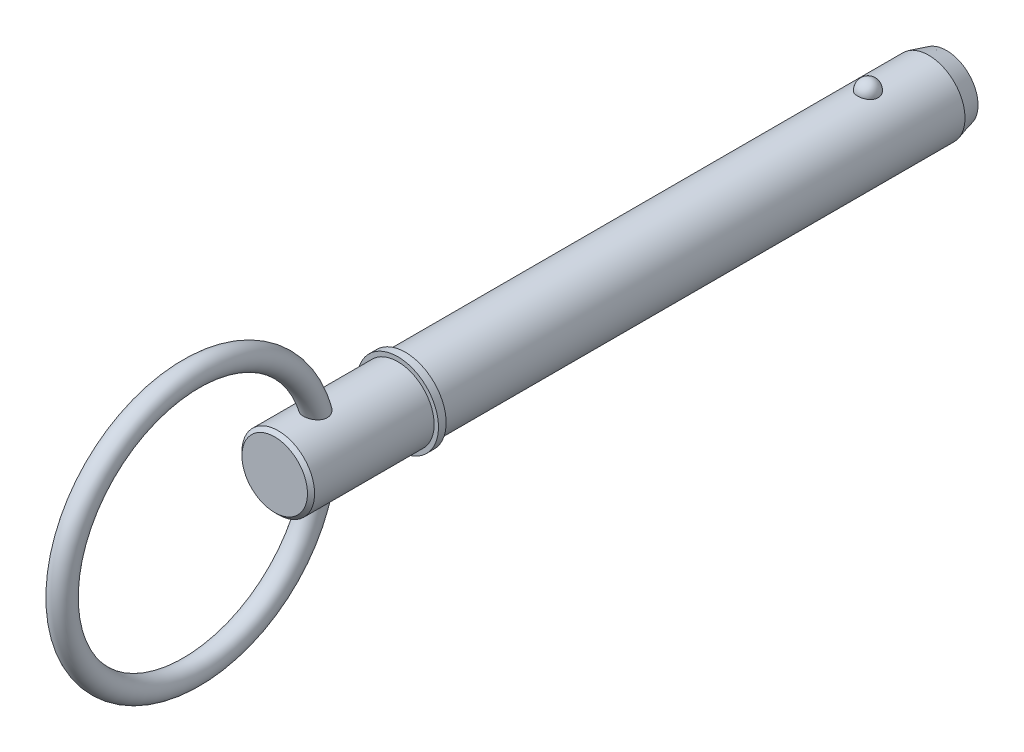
ISO-10303-21;
HEADER;
FILE_DESCRIPTION(('STEP AP214'),'2;1');
FILE_NAME('part.step','',(''),(''),'','','');
FILE_SCHEMA(('AUTOMOTIVE_DESIGN { 1 0 10303 214 1 1 1 1 }'));
ENDSEC;
DATA;
#1=APPLICATION_CONTEXT('core data for automotive mechanical design processes');
#2=APPLICATION_PROTOCOL_DEFINITION('international standard','automotive_design',2000,#1);
#3=PRODUCT_CONTEXT('',#1,'mechanical');
#4=PRODUCT('Part','Part','',(#3));
#5=PRODUCT_RELATED_PRODUCT_CATEGORY('part','',(#4));
#6=PRODUCT_DEFINITION_FORMATION('','',#4);
#7=PRODUCT_DEFINITION_CONTEXT('part definition',#1,'design');
#8=PRODUCT_DEFINITION('design','',#6,#7);
#9=PRODUCT_DEFINITION_SHAPE('','',#8);
#10=(LENGTH_UNIT() NAMED_UNIT(*) SI_UNIT(.MILLI.,.METRE.));
#11=(NAMED_UNIT(*) PLANE_ANGLE_UNIT() SI_UNIT($,.RADIAN.));
#12=(NAMED_UNIT(*) SI_UNIT($,.STERADIAN.) SOLID_ANGLE_UNIT());
#13=UNCERTAINTY_MEASURE_WITH_UNIT(LENGTH_MEASURE(1.E-05),#10,'distance_accuracy_value','');
#14=(GEOMETRIC_REPRESENTATION_CONTEXT(3) GLOBAL_UNCERTAINTY_ASSIGNED_CONTEXT((#13)) GLOBAL_UNIT_ASSIGNED_CONTEXT((#10,
#11,#12)) REPRESENTATION_CONTEXT('',''));
#15=CARTESIAN_POINT('',(0.,0.,0.));
#16=DIRECTION('',(0.,0.,1.));
#17=DIRECTION('',(1.,0.,0.));
#18=AXIS2_PLACEMENT_3D('',#15,#16,#17);
#19=CARTESIAN_POINT('',(0.,0.,88.9));
#20=DIRECTION('',(0.,0.,-1.));
#21=DIRECTION('',(-1.,0.,0.));
#22=AXIS2_PLACEMENT_3D('',#19,#20,#21);
#23=CYLINDRICAL_SURFACE('',#22,7.145);
#24=CARTESIAN_POINT('',(1.99971637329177,6.85945766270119,-2.02));
#25=CARTESIAN_POINT('',(1.9997145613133,6.85945924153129,-1.9070973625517));
#26=CARTESIAN_POINT('',(1.99051486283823,6.86216053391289,-1.79417185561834));
#27=CARTESIAN_POINT('',(1.95393597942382,6.87266409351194,-1.57152267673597));
#28=CARTESIAN_POINT('',(1.92655029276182,6.88046818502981,-1.46180016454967));
#29=CARTESIAN_POINT('',(1.85429435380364,6.90029063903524,-1.24873107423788));
#30=CARTESIAN_POINT('',(1.80943177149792,6.91230715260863,-1.14538172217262));
#31=CARTESIAN_POINT('',(1.70333474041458,6.93921158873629,-0.947875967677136));
#32=CARTESIAN_POINT('',(1.64210059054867,6.95409945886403,-0.853719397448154));
#33=CARTESIAN_POINT('',(1.5044381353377,6.98517577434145,-0.67672157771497));
#34=CARTESIAN_POINT('',(1.42793505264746,7.00137037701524,-0.593939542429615));
#35=CARTESIAN_POINT('',(1.26189697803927,7.03319066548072,-0.442536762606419));
#36=CARTESIAN_POINT('',(1.17236198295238,7.04881635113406,-0.37391602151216));
#37=CARTESIAN_POINT('',(0.982932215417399,7.0777121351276,-0.252935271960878));
#38=CARTESIAN_POINT('',(0.883068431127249,7.09098897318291,-0.200528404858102));
#39=CARTESIAN_POINT('',(0.675560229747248,7.11375589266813,-0.11321230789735));
#40=CARTESIAN_POINT('',(0.567916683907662,7.12324639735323,-0.0783011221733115));
#41=CARTESIAN_POINT('',(0.350006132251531,7.13724173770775,-0.02747075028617));
#42=CARTESIAN_POINT('',(0.239822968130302,7.14183447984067,-0.0112162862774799));
#43=CARTESIAN_POINT('',(0.0181946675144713,7.14583597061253,0.00296794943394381));
#44=CARTESIAN_POINT('',(-0.0932503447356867,7.14524522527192,0.000899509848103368));
#45=CARTESIAN_POINT('',(-0.312527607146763,7.13899247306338,-0.0213331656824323));
#46=CARTESIAN_POINT('',(-0.420388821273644,7.13340426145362,-0.0412340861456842));
#47=CARTESIAN_POINT('',(-0.631141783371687,7.11785474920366,-0.098204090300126));
#48=CARTESIAN_POINT('',(-0.734033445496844,7.10789337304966,-0.135273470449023));
#49=CARTESIAN_POINT('',(-0.932634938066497,7.08458058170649,-0.225826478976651));
#50=CARTESIAN_POINT('',(-1.02829911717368,7.07120963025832,-0.279405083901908));
#51=CARTESIAN_POINT('',(-1.20927180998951,7.04252043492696,-0.401457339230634));
#52=CARTESIAN_POINT('',(-1.29457925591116,7.02720199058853,-0.469932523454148));
#53=CARTESIAN_POINT('',(-1.45423311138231,6.995926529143,-0.621438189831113));
#54=CARTESIAN_POINT('',(-1.5283348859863,6.97996288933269,-0.704725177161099));
#55=CARTESIAN_POINT('',(-1.66169281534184,6.94942414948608,-0.882667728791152));
#56=CARTESIAN_POINT('',(-1.72094789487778,6.93484915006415,-0.977324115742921));
#57=CARTESIAN_POINT('',(-1.82375276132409,6.90853186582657,-1.17661373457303));
#58=CARTESIAN_POINT('',(-1.86711024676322,6.8968248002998,-1.28135093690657));
#59=CARTESIAN_POINT('',(-1.9360425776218,6.87779420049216,-1.4968998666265));
#60=CARTESIAN_POINT('',(-1.96161794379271,6.87047053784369,-1.60771141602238));
#61=CARTESIAN_POINT('',(-1.99427437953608,6.86106309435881,-1.83176258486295));
#62=CARTESIAN_POINT('',(-2.00143373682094,6.8589571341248,-1.9449898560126));
#63=CARTESIAN_POINT('',(-1.99730449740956,6.86016064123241,-2.17107603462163));
#64=CARTESIAN_POINT('',(-1.98601641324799,6.86346995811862,-2.28393495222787));
#65=CARTESIAN_POINT('',(-1.94538181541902,6.87509649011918,-2.5054843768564));
#66=CARTESIAN_POINT('',(-1.91612773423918,6.88338806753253,-2.61419321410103));
#67=CARTESIAN_POINT('',(-1.84036449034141,6.90402888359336,-2.82501243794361));
#68=CARTESIAN_POINT('',(-1.79385462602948,6.91637828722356,-2.92712255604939));
#69=CARTESIAN_POINT('',(-1.68442067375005,6.94384180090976,-3.12247704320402));
#70=CARTESIAN_POINT('',(-1.62140729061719,6.95897081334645,-3.21566929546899));
#71=CARTESIAN_POINT('',(-1.4806650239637,6.99026742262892,-3.38999412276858));
#72=CARTESIAN_POINT('',(-1.40293556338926,7.00643506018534,-3.47112622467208));
#73=CARTESIAN_POINT('',(-1.2344320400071,7.03807960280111,-3.61938672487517));
#74=CARTESIAN_POINT('',(-1.1436092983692,7.05355363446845,-3.68646046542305));
#75=CARTESIAN_POINT('',(-0.9515914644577,7.08201263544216,-3.80431973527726));
#76=CARTESIAN_POINT('',(-0.850397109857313,7.09499778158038,-3.85510642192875));
#77=CARTESIAN_POINT('',(-0.641823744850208,7.11687679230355,-3.93839532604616));
#78=CARTESIAN_POINT('',(-0.534539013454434,7.1258202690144,-3.9711204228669));
#79=CARTESIAN_POINT('',(-0.315743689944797,7.1388605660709,-4.01830716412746));
#80=CARTESIAN_POINT('',(-0.204233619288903,7.14295798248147,-4.03277105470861));
#81=CARTESIAN_POINT('',(0.0175518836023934,7.14582273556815,-4.04291389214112));
#82=CARTESIAN_POINT('',(0.127809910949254,7.14469090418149,-4.03894819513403));
#83=CARTESIAN_POINT('',(0.346044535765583,7.13745046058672,-4.01315850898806));
#84=CARTESIAN_POINT('',(0.454021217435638,7.13134203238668,-3.99133518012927));
#85=CARTESIAN_POINT('',(0.664227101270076,7.11483713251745,-3.93057164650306));
#86=CARTESIAN_POINT('',(0.766477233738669,7.10445761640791,-3.89169908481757));
#87=CARTESIAN_POINT('',(0.96292921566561,7.08050813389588,-3.79792023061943));
#88=CARTESIAN_POINT('',(1.05713054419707,7.06693796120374,-3.7430129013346));
#89=CARTESIAN_POINT('',(1.23644031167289,7.03780007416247,-3.61765173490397));
#90=CARTESIAN_POINT('',(1.32138387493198,7.0222044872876,-3.54696861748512));
#91=CARTESIAN_POINT('',(1.47830582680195,6.99085504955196,-3.39245228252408));
#92=CARTESIAN_POINT('',(1.55028198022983,6.97510117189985,-3.30861680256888));
#93=CARTESIAN_POINT('',(1.68063701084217,6.94485803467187,-3.12843058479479));
#94=CARTESIAN_POINT('',(1.73875175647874,6.93039619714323,-3.03188405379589));
#95=CARTESIAN_POINT('',(1.83823393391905,6.90467783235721,-2.83015210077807));
#96=CARTESIAN_POINT('',(1.87960712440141,6.89342020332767,-2.72496966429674));
#97=CARTESIAN_POINT('',(1.94111647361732,6.87633596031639,-2.52050234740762));
#98=CARTESIAN_POINT('',(1.96305249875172,6.87005682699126,-2.42179225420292));
#99=CARTESIAN_POINT('',(1.99235308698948,6.86161702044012,-2.22206084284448));
#100=CARTESIAN_POINT('',(1.99971799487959,6.85945624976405,-2.12103957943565));
#101=CARTESIAN_POINT('',(1.99971637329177,6.85945766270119,-2.02));
#102=B_SPLINE_CURVE_WITH_KNOTS('',3,(#24,#25,#26,#27,#28,#29,#30,#31,#32,#33,#34,#35,#36,#37,
#38,#39,#40,#41,#42,#43,#44,#45,#46,#47,#48,#49,#50,#51,#52,#53,#54,#55,#56,#57,#58,#59,#60,#61,
#62,#63,#64,#65,#66,#67,#68,#69,#70,#71,#72,#73,#74,#75,#76,#77,#78,#79,#80,#81,#82,#83,#84,#85,
#86,#87,#88,#89,#90,#91,#92,#93,#94,#95,#96,#97,#98,#99,#100,#101),.UNSPECIFIED.,.T.,.F.,(4,2,2,
2,2,2,2,2,2,2,2,2,2,2,2,2,2,2,2,2,2,2,2,2,2,2,2,2,2,2,2,2,2,2,2,2,2,2,4),(0.,0.338345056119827,
0.67681114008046,1.01512885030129,1.35344038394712,1.69345130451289,2.0334623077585,
2.37248128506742,2.71146235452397,3.04425125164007,3.37700766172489,3.70493009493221,
4.03285819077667,4.36270921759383,4.69259422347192,5.02887632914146,5.36518278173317,
5.70543263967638,6.04567253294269,6.38446363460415,6.72324532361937,7.0602984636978,
7.39736530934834,7.73629500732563,8.07523799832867,8.4154752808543,8.7556883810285,
9.09160363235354,9.42747756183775,9.75690239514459,10.0863150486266,10.4144324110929,
10.7425709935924,11.0758313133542,11.4091490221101,11.748385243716,12.0875046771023,
12.3903058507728,12.6930998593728),.UNSPECIFIED.);
#103=CARTESIAN_POINT('',(1.99971637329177,6.85945766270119,-2.02));
#104=VERTEX_POINT('',#103);
#105=EDGE_CURVE('E102',#104,#104,#102,.T.);
#106=ORIENTED_EDGE('',*,*,#105,.T.);
#107=EDGE_LOOP('',(#106));
#108=FACE_BOUND('',#107,.T.);
#109=CARTESIAN_POINT('',(0.,0.,-13.9499999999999));
#110=DIRECTION('',(0.,0.,-1.));
#111=DIRECTION('',(-1.,0.,0.));
#112=AXIS2_PLACEMENT_3D('',#109,#110,#111);
#113=CIRCLE('',#112,7.145);
#114=CARTESIAN_POINT('',(-7.145,0.,-13.9499999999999));
#115=VERTEX_POINT('',#114);
#116=EDGE_CURVE('E110',#115,#115,#113,.F.);
#117=ORIENTED_EDGE('',*,*,#116,.T.);
#118=EDGE_LOOP('',(#117));
#119=FACE_BOUND('',#118,.T.);
#120=CARTESIAN_POINT('',(0.,0.,88.9));
#121=DIRECTION('',(0.,0.,1.));
#122=DIRECTION('',(1.,0.,0.));
#123=AXIS2_PLACEMENT_3D('',#120,#121,#122);
#124=CIRCLE('',#123,7.145);
#125=CARTESIAN_POINT('',(7.145,0.,88.9));
#126=VERTEX_POINT('',#125);
#127=EDGE_CURVE('E108',#126,#126,#124,.T.);
#128=ORIENTED_EDGE('',*,*,#127,.F.);
#129=EDGE_LOOP('',(#128));
#130=FACE_BOUND('',#129,.T.);
#131=ADVANCED_FACE('F39',(#108,#119,#130),#23,.T.);
#132=CARTESIAN_POINT('',(0.,0.,-17.45));
#133=DIRECTION('',(0.,0.,-1.));
#134=DIRECTION('',(-1.,0.,0.));
#135=AXIS2_PLACEMENT_3D('',#132,#133,#134);
#136=PLANE('',#135);
#137=CARTESIAN_POINT('',(0.,0.,-17.45));
#138=DIRECTION('',(0.,0.,-1.));
#139=DIRECTION('',(-1.,0.,0.));
#140=AXIS2_PLACEMENT_3D('',#137,#138,#139);
#141=CIRCLE('',#140,6.20717782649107);
#142=CARTESIAN_POINT('',(-6.20717782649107,0.,-17.45));
#143=VERTEX_POINT('',#142);
#144=EDGE_CURVE('E142',#143,#143,#141,.T.);
#145=ORIENTED_EDGE('',*,*,#144,.T.);
#146=EDGE_LOOP('',(#145));
#147=FACE_BOUND('',#146,.T.);
#148=ADVANCED_FACE('F88',(#147),#136,.T.);
#149=CARTESIAN_POINT('',(0.,0.,-17.45));
#150=DIRECTION('',(0.,0.,1.));
#151=DIRECTION('',(1.,0.,0.));
#152=AXIS2_PLACEMENT_3D('',#149,#150,#151);
#153=CONICAL_SURFACE('',#152,6.20717782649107,0.261799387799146);
#154=ORIENTED_EDGE('',*,*,#116,.F.);
#155=EDGE_LOOP('',(#154));
#156=FACE_BOUND('',#155,.T.);
#157=ORIENTED_EDGE('',*,*,#144,.F.);
#158=EDGE_LOOP('',(#157));
#159=FACE_BOUND('',#158,.T.);
#160=ADVANCED_FACE('F94',(#156,#159),#153,.T.);
#161=CARTESIAN_POINT('',(0.,7.145,-2.02));
#162=DIRECTION('',(0.,1.,0.));
#163=DIRECTION('',(0.,0.,1.));
#164=AXIS2_PLACEMENT_3D('',#161,#162,#163);
#165=SPHERICAL_SURFACE('',#164,2.02);
#166=ORIENTED_EDGE('',*,*,#105,.F.);
#167=EDGE_LOOP('',(#166));
#168=FACE_BOUND('',#167,.T.);
#169=ADVANCED_FACE('F113',(#168),#165,.T.);
#170=CARTESIAN_POINT('',(0.,0.,88.9));
#171=DIRECTION('',(0.,0.,-1.));
#172=DIRECTION('',(-1.,0.,0.));
#173=AXIS2_PLACEMENT_3D('',#170,#171,#172);
#174=PLANE('',#173);
#175=ORIENTED_EDGE('',*,*,#127,.T.);
#176=EDGE_LOOP('',(#175));
#177=FACE_BOUND('',#176,.T.);
#178=CARTESIAN_POINT('',(0.,0.,88.9));
#179=DIRECTION('',(0.,0.,-1.));
#180=DIRECTION('',(-1.,0.,0.));
#181=AXIS2_PLACEMENT_3D('',#178,#179,#180);
#182=CIRCLE('',#181,8.);
#183=CARTESIAN_POINT('',(-8.,0.,88.9));
#184=VERTEX_POINT('',#183);
#185=EDGE_CURVE('E109',#184,#184,#182,.T.);
#186=ORIENTED_EDGE('',*,*,#185,.T.);
#187=EDGE_LOOP('',(#186));
#188=FACE_BOUND('',#187,.T.);
#189=ADVANCED_FACE('F117',(#177,#188),#174,.T.);
#190=CARTESIAN_POINT('',(0.,0.,33.7287874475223));
#191=DIRECTION('',(0.,0.,-1.));
#192=DIRECTION('',(-1.,0.,0.));
#193=AXIS2_PLACEMENT_3D('',#190,#191,#192);
#194=CYLINDRICAL_SURFACE('',#193,8.);
#195=CARTESIAN_POINT('',(0.,0.,90.4));
#196=DIRECTION('',(0.,0.,-1.));
#197=DIRECTION('',(-1.,0.,0.));
#198=AXIS2_PLACEMENT_3D('',#195,#196,#197);
#199=CIRCLE('',#198,8.);
#200=CARTESIAN_POINT('',(-8.,0.,90.4));
#201=VERTEX_POINT('',#200);
#202=EDGE_CURVE('E134',#201,#201,#199,.T.);
#203=ORIENTED_EDGE('',*,*,#202,.T.);
#204=EDGE_LOOP('',(#203));
#205=FACE_BOUND('',#204,.T.);
#206=ORIENTED_EDGE('',*,*,#185,.F.);
#207=EDGE_LOOP('',(#206));
#208=FACE_BOUND('',#207,.T.);
#209=ADVANCED_FACE('F121',(#205,#208),#194,.T.);
#210=CARTESIAN_POINT('',(0.,8.,90.4));
#211=DIRECTION('',(0.,0.,1.));
#212=DIRECTION('',(1.,0.,0.));
#213=AXIS2_PLACEMENT_3D('',#210,#211,#212);
#214=PLANE('',#213);
#215=CARTESIAN_POINT('',(0.,0.,90.4));
#216=DIRECTION('',(0.,0.,1.));
#217=DIRECTION('',(1.,0.,0.));
#218=AXIS2_PLACEMENT_3D('',#215,#216,#217);
#219=CIRCLE('',#218,7.145);
#220=CARTESIAN_POINT('',(7.145,0.,90.4));
#221=VERTEX_POINT('',#220);
#222=EDGE_CURVE('E112',#221,#221,#219,.T.);
#223=ORIENTED_EDGE('',*,*,#222,.F.);
#224=EDGE_LOOP('',(#223));
#225=FACE_BOUND('',#224,.T.);
#226=ORIENTED_EDGE('',*,*,#202,.F.);
#227=EDGE_LOOP('',(#226));
#228=FACE_BOUND('',#227,.T.);
#229=ADVANCED_FACE('F85',(#225,#228),#214,.T.);
#230=CARTESIAN_POINT('',(0.,0.,114.6));
#231=DIRECTION('',(0.,0.,-1.));
#232=DIRECTION('',(-1.,0.,0.));
#233=AXIS2_PLACEMENT_3D('',#230,#231,#232);
#234=CYLINDRICAL_SURFACE('',#233,7.145);
#235=CARTESIAN_POINT('',(-1.03551034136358,-7.0695645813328,104.530259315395));
#236=CARTESIAN_POINT('',(-0.923225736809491,-7.08601142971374,104.474402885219));
#237=CARTESIAN_POINT('',(-0.806039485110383,-7.10042113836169,104.427835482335));
#238=CARTESIAN_POINT('',(-0.565173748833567,-7.1236385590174,104.354279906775));
#239=CARTESIAN_POINT('',(-0.441495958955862,-7.13244772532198,104.327286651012));
#240=CARTESIAN_POINT('',(-0.191106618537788,-7.14354309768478,104.293450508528));
#241=CARTESIAN_POINT('',(-0.0643945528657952,-7.14582818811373,104.286611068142));
#242=CARTESIAN_POINT('',(0.188443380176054,-7.14363337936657,104.293241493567));
#243=CARTESIAN_POINT('',(0.314569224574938,-7.13915321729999,104.306712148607));
#244=CARTESIAN_POINT('',(0.562499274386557,-7.12390574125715,104.35364165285));
#245=CARTESIAN_POINT('',(0.684308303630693,-7.11314569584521,104.387077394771));
#246=CARTESIAN_POINT('',(0.920329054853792,-7.08647538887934,104.473194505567));
#247=CARTESIAN_POINT('',(1.03454038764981,-7.07056486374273,104.525876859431));
#248=CARTESIAN_POINT('',(1.25232634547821,-7.03526161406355,104.6494470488));
#249=CARTESIAN_POINT('',(1.35588248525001,-7.01586299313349,104.72036580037));
#250=CARTESIAN_POINT('',(1.54916093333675,-6.9757352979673,104.878757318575));
#251=CARTESIAN_POINT('',(1.63888414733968,-6.95500631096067,104.966229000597));
#252=CARTESIAN_POINT('',(1.80113983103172,-6.91475703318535,105.154727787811));
#253=CARTESIAN_POINT('',(1.8738192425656,-6.89522757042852,105.255626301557));
#254=CARTESIAN_POINT('',(2.00091178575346,-6.85942834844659,105.46884010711));
#255=CARTESIAN_POINT('',(2.05532963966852,-6.8431577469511,105.581152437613));
#256=CARTESIAN_POINT('',(2.14350100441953,-6.81604873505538,105.811194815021));
#257=CARTESIAN_POINT('',(2.17770329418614,-6.80509340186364,105.928739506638));
#258=CARTESIAN_POINT('',(2.22691394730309,-6.7891497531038,106.168149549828));
#259=CARTESIAN_POINT('',(2.2419216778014,-6.7841616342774,106.290015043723));
#260=CARTESIAN_POINT('',(2.25313992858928,-6.78044381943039,106.53580699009));
#261=CARTESIAN_POINT('',(2.24917302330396,-6.78177319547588,106.659742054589));
#262=CARTESIAN_POINT('',(2.22301329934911,-6.79039131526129,106.905438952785));
#263=CARTESIAN_POINT('',(2.20081491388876,-6.79768187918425,107.0272001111));
#264=CARTESIAN_POINT('',(2.13702421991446,-6.81801706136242,107.275287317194));
#265=CARTESIAN_POINT('',(2.09404815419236,-6.83146790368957,107.401223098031));
#266=CARTESIAN_POINT('',(1.9898638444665,-6.86253672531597,107.644824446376));
#267=CARTESIAN_POINT('',(1.9286413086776,-6.88015796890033,107.762483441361));
#268=CARTESIAN_POINT('',(1.78274362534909,-6.91947130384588,107.997497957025));
#269=CARTESIAN_POINT('',(1.69640701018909,-6.94139021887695,108.113789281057));
#270=CARTESIAN_POINT('',(1.50503944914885,-6.98537683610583,108.329799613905));
#271=CARTESIAN_POINT('',(1.40001969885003,-7.00744444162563,108.429528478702));
#272=CARTESIAN_POINT('',(1.19221781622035,-7.04548349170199,108.593170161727));
#273=CARTESIAN_POINT('',(1.09203347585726,-7.06185586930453,108.66028599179));
#274=CARTESIAN_POINT('',(0.881607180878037,-7.09119477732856,108.777337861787));
#275=CARTESIAN_POINT('',(0.771372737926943,-7.10416382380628,108.827286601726));
#276=CARTESIAN_POINT('',(0.542622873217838,-7.12529560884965,108.907475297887));
#277=CARTESIAN_POINT('',(0.424058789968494,-7.13342692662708,108.93758654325));
#278=CARTESIAN_POINT('',(0.183155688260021,-7.1436662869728,108.975370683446));
#279=CARTESIAN_POINT('',(0.0608191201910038,-7.14577815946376,108.983057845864));
#280=CARTESIAN_POINT('',(-0.169367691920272,-7.14381572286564,108.975860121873));
#281=CARTESIAN_POINT('',(-0.277308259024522,-7.14040669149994,108.963402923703));
#282=CARTESIAN_POINT('',(-0.489468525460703,-7.12900651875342,108.921156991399));
#283=CARTESIAN_POINT('',(-0.593687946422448,-7.12101503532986,108.891366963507));
#284=CARTESIAN_POINT('',(-0.796149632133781,-7.10123695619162,108.815987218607));
#285=CARTESIAN_POINT('',(-0.894373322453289,-7.08943921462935,108.770351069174));
#286=CARTESIAN_POINT('',(-1.08274371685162,-7.06312621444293,108.665336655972));
#287=CARTESIAN_POINT('',(-1.17288754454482,-7.04860999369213,108.605953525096));
#288=CARTESIAN_POINT('',(-1.35484961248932,-7.01605385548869,108.467113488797));
#289=CARTESIAN_POINT('',(-1.44541008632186,-6.99780069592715,108.386061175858));
#290=CARTESIAN_POINT('',(-1.61364655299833,-6.96093393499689,108.211599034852));
#291=CARTESIAN_POINT('',(-1.69131381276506,-6.94232009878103,108.118180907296));
#292=CARTESIAN_POINT('',(-1.843300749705,-6.90364386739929,107.906608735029));
#293=CARTESIAN_POINT('',(-1.9154309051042,-6.88377370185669,107.786839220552));
#294=CARTESIAN_POINT('',(-2.04002946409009,-6.84788436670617,107.536875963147));
#295=CARTESIAN_POINT('',(-2.09248830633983,-6.83186707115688,107.406677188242));
#296=CARTESIAN_POINT('',(-2.17795964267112,-6.80511869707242,107.132555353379));
#297=CARTESIAN_POINT('',(-2.20992909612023,-6.79467512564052,106.988274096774));
#298=CARTESIAN_POINT('',(-2.24813111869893,-6.78213595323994,106.695984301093));
#299=CARTESIAN_POINT('',(-2.25438316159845,-6.78003403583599,106.547978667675));
#300=CARTESIAN_POINT('',(-2.24011368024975,-6.78475868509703,106.265430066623));
#301=CARTESIAN_POINT('',(-2.22172362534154,-6.79087455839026,106.130769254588));
#302=CARTESIAN_POINT('',(-2.16145328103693,-6.81029672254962,105.867367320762));
#303=CARTESIAN_POINT('',(-2.11958615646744,-6.82359898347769,105.738622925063));
#304=CARTESIAN_POINT('',(-2.01784121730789,-6.85433303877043,105.502267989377));
#305=CARTESIAN_POINT('',(-1.95982394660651,-6.8713108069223,105.393792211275));
#306=CARTESIAN_POINT('',(-1.82642155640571,-6.90796511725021,105.188591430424));
#307=CARTESIAN_POINT('',(-1.75103235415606,-6.92764229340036,105.091869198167));
#308=CARTESIAN_POINT('',(-1.57825515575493,-6.96911949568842,104.905408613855));
#309=CARTESIAN_POINT('',(-1.47957996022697,-6.99096237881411,104.81687037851));
#310=CARTESIAN_POINT('',(-1.26760341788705,-7.0324852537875,104.658840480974));
#311=CARTESIAN_POINT('',(-1.15429989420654,-7.05216492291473,104.589351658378));
#312=CARTESIAN_POINT('',(-1.03551034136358,-7.0695645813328,104.530259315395));
#313=B_SPLINE_CURVE_WITH_KNOTS('',3,(#235,#236,#237,#238,#239,#240,#241,#242,#243,#244,#245,
#246,#247,#248,#249,#250,#251,#252,#253,#254,#255,#256,#257,#258,#259,#260,#261,#262,#263,#264,
#265,#266,#267,#268,#269,#270,#271,#272,#273,#274,#275,#276,#277,#278,#279,#280,#281,#282,#283,
#284,#285,#286,#287,#288,#289,#290,#291,#292,#293,#294,#295,#296,#297,#298,#299,#300,#301,#302,
#303,#304,#305,#306,#307,#308,#309,#310,#311,#312),.UNSPECIFIED.,.T.,.F.,(4,2,2,2,2,2,2,2,2,2,2,
2,2,2,2,2,2,2,2,2,2,2,2,2,2,2,2,2,2,2,2,2,2,2,2,2,2,2,4),(0.,0.378979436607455,
0.757860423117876,1.13680619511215,1.51576669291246,1.89428943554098,2.2728315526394,
2.65201969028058,3.03118299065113,3.4069461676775,3.78261210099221,4.14959041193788,
4.5165808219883,4.88700951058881,5.25755134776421,5.65713708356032,6.05703662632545,
6.49445595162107,6.93161403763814,7.29520224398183,7.65852089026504,8.02417421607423,
8.38959483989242,8.71415763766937,9.0387446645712,9.36429093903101,9.68995264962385,
10.0572255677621,10.4247462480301,10.8465602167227,11.2685789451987,11.7106604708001,
12.152407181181,12.5583067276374,12.9639788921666,13.3347314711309,13.7055712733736,
14.1064462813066,14.5073810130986),.UNSPECIFIED.);
#314=CARTESIAN_POINT('',(-1.03551034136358,-7.0695645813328,104.530259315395));
#315=VERTEX_POINT('',#314);
#316=EDGE_CURVE('E10',#315,#315,#313,.T.);
#317=ORIENTED_EDGE('',*,*,#316,.F.);
#318=EDGE_LOOP('',(#317));
#319=FACE_BOUND('',#318,.T.);
#320=CARTESIAN_POINT('',(-1.03551034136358,7.0695645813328,104.530259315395));
#321=CARTESIAN_POINT('',(-1.14644953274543,7.0533145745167,104.585446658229));
#322=CARTESIAN_POINT('',(-1.25260902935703,7.03507806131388,104.649702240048));
#323=CARTESIAN_POINT('',(-1.45240021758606,6.99656564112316,104.794958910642));
#324=CARTESIAN_POINT('',(-1.54602879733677,6.97628922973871,104.875964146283));
#325=CARTESIAN_POINT('',(-1.71815091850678,6.93590796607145,105.052910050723));
#326=CARTESIAN_POINT('',(-1.79663177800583,6.91580327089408,105.148863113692));
#327=CARTESIAN_POINT('',(-1.93607718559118,6.87807159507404,105.353162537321));
#328=CARTESIAN_POINT('',(-1.99704642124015,6.86044395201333,105.461505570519));
#329=CARTESIAN_POINT('',(-2.09894945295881,6.82995115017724,105.685542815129));
#330=CARTESIAN_POINT('',(-2.1402125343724,6.81700866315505,105.801076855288));
#331=CARTESIAN_POINT('',(-2.20347311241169,6.79682602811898,106.037758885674));
#332=CARTESIAN_POINT('',(-2.22547114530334,6.78958572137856,106.158906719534));
#333=CARTESIAN_POINT('',(-2.25026114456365,6.78140983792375,106.403214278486));
#334=CARTESIAN_POINT('',(-2.25306986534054,6.78046876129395,106.52637215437));
#335=CARTESIAN_POINT('',(-2.2403056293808,6.78469532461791,106.771604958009));
#336=CARTESIAN_POINT('',(-2.22472720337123,6.78986478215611,106.893679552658));
#337=CARTESIAN_POINT('',(-2.17472134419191,6.8060520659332,107.142036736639));
#338=CARTESIAN_POINT('',(-2.13910164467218,6.81743831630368,107.268053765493));
#339=CARTESIAN_POINT('',(-2.04975058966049,6.84483151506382,107.512973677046));
#340=CARTESIAN_POINT('',(-1.99600968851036,6.86084089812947,107.631872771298));
#341=CARTESIAN_POINT('',(-1.86558545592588,6.8975101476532,107.871425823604));
#342=CARTESIAN_POINT('',(-1.78715729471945,6.91847353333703,107.991087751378));
#343=CARTESIAN_POINT('',(-1.61149373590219,6.96148580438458,108.215646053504));
#344=CARTESIAN_POINT('',(-1.51424701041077,6.98353533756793,108.32053346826));
#345=CARTESIAN_POINT('',(-1.30107590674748,7.02639179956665,108.512951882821));
#346=CARTESIAN_POINT('',(-1.18492282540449,7.04717858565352,108.600236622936));
#347=CARTESIAN_POINT('',(-0.937392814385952,7.08434208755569,108.750827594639));
#348=CARTESIAN_POINT('',(-0.806039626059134,7.10072555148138,108.814170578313));
#349=CARTESIAN_POINT('',(-0.550470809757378,7.12475629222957,108.905483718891));
#350=CARTESIAN_POINT('',(-0.427643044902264,7.13327781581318,108.937047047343));
#351=CARTESIAN_POINT('',(-0.240556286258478,7.14122488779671,108.966356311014));
#352=CARTESIAN_POINT('',(-0.177714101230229,7.14306799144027,108.973119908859));
#353=CARTESIAN_POINT('',(-0.0516470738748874,7.14509121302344,108.980539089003));
#354=CARTESIAN_POINT('',(0.0115777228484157,7.14527152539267,108.981195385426));
#355=CARTESIAN_POINT('',(0.182932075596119,7.14347436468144,108.974616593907));
#356=CARTESIAN_POINT('',(0.290871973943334,7.13986325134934,108.961408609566));
#357=CARTESIAN_POINT('',(0.502842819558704,7.1280769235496,108.917690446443));
#358=CARTESIAN_POINT('',(0.606873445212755,7.11990133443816,108.887178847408));
#359=CARTESIAN_POINT('',(0.809001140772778,7.09978218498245,108.810378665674));
#360=CARTESIAN_POINT('',(0.907071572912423,7.08782300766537,108.764024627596));
#361=CARTESIAN_POINT('',(1.09503957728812,7.0612282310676,108.657620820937));
#362=CARTESIAN_POINT('',(1.18493426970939,7.04659169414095,108.597566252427));
#363=CARTESIAN_POINT('',(1.36644041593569,7.01380352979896,108.457233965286));
#364=CARTESIAN_POINT('',(1.45676563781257,6.99544216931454,108.375344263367));
#365=CARTESIAN_POINT('',(1.6244063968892,6.95842750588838,108.199231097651));
#366=CARTESIAN_POINT('',(1.70171298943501,6.93977401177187,108.104999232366));
#367=CARTESIAN_POINT('',(1.85271606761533,6.90111647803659,107.891807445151));
#368=CARTESIAN_POINT('',(1.92421731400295,6.88131605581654,107.771248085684));
#369=CARTESIAN_POINT('',(2.04739198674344,6.84567995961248,107.519785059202));
#370=CARTESIAN_POINT('',(2.0990562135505,6.82984612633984,107.388876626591));
#371=CARTESIAN_POINT('',(2.1825776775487,6.80363167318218,107.113847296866));
#372=CARTESIAN_POINT('',(2.21345394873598,6.79352430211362,106.969397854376));
#373=CARTESIAN_POINT('',(2.24941288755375,6.78170753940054,106.676984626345));
#374=CARTESIAN_POINT('',(2.2545156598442,6.77999160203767,106.529023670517));
#375=CARTESIAN_POINT('',(2.2380435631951,6.78544298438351,106.247053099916));
#376=CARTESIAN_POINT('',(2.21864521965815,6.79188566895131,106.112903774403));
#377=CARTESIAN_POINT('',(2.1564876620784,6.81187529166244,105.850690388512));
#378=CARTESIAN_POINT('',(2.11373989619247,6.82541874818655,105.72262337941));
#379=CARTESIAN_POINT('',(2.01040099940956,6.85652522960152,105.487507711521));
#380=CARTESIAN_POINT('',(1.9516260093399,6.87365110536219,105.379597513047));
#381=CARTESIAN_POINT('',(1.81683142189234,6.91050025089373,105.175649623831));
#382=CARTESIAN_POINT('',(1.74081238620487,6.93022343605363,105.079611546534));
#383=CARTESIAN_POINT('',(1.57431234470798,6.96992220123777,104.90254183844));
#384=CARTESIAN_POINT('',(1.48394688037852,6.98989467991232,104.821400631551));
#385=CARTESIAN_POINT('',(1.29081365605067,7.02812243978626,104.675038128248));
#386=CARTESIAN_POINT('',(1.18804491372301,7.04637758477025,104.609818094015));
#387=CARTESIAN_POINT('',(0.970386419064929,7.07967210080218,104.495377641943));
#388=CARTESIAN_POINT('',(0.855272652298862,7.09462807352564,104.446558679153));
#389=CARTESIAN_POINT('',(0.618143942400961,7.11920826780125,104.368071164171));
#390=CARTESIAN_POINT('',(0.496128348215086,7.12883198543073,104.338404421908));
#391=CARTESIAN_POINT('',(0.247581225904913,7.14180209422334,104.298698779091));
#392=CARTESIAN_POINT('',(0.12102076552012,7.14509609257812,104.288823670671));
#393=CARTESIAN_POINT('',(-0.132022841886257,7.14489967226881,104.289415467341));
#394=CARTESIAN_POINT('',(-0.258506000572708,7.14141109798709,104.299876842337));
#395=CARTESIAN_POINT('',(-0.496649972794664,7.12862600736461,104.339053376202));
#396=CARTESIAN_POINT('',(-0.608625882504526,7.11987587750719,104.366055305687));
#397=CARTESIAN_POINT('',(-0.826925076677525,7.09783467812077,104.436222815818));
#398=CARTESIAN_POINT('',(-0.933248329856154,7.08454358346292,104.479388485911));
#399=CARTESIAN_POINT('',(-1.03551034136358,7.0695645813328,104.530259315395));
#400=B_SPLINE_CURVE_WITH_KNOTS('',3,(#320,#321,#322,#323,#324,#325,#326,#327,#328,#329,#330,
#331,#332,#333,#334,#335,#336,#337,#338,#339,#340,#341,#342,#343,#344,#345,#346,#347,#348,#349,
#350,#351,#352,#353,#354,#355,#356,#357,#358,#359,#360,#361,#362,#363,#364,#365,#366,#367,#368,
#369,#370,#371,#372,#373,#374,#375,#376,#377,#378,#379,#380,#381,#382,#383,#384,#385,#386,#387,
#388,#389,#390,#391,#392,#393,#394,#395,#396,#397,#398,#399),.UNSPECIFIED.,.T.,.F.,(4,2,2,2,2,2,
2,2,2,2,2,2,2,2,2,2,2,2,2,2,2,2,2,2,2,2,2,2,2,2,2,2,2,2,2,2,2,2,2,4),(0.,0.374504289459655,
0.749101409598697,1.12401080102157,1.49881974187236,1.86712525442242,2.23542051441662,
2.60339417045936,2.97147730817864,3.36420696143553,3.75714381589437,4.18898920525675,
4.62109535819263,5.05888124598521,5.49599234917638,5.87475353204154,6.0641680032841,
6.25356032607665,6.57826179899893,6.90298992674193,7.22907626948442,7.55527703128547,
7.92373585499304,8.29244681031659,8.71527472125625,9.13829848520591,9.58009907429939,
10.0215549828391,10.4264139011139,10.831074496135,11.2014904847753,11.571894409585,
11.9394538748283,12.3070424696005,12.6830655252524,13.0591241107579,13.4382822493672,
13.8173372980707,14.1625475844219,14.5077597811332),.UNSPECIFIED.);
#401=CARTESIAN_POINT('',(-1.03551034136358,7.0695645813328,104.530259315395));
#402=VERTEX_POINT('',#401);
#403=EDGE_CURVE('E51',#402,#402,#400,.T.);
#404=ORIENTED_EDGE('',*,*,#403,.F.);
#405=EDGE_LOOP('',(#404));
#406=FACE_BOUND('',#405,.T.);
#407=CARTESIAN_POINT('',(0.,0.,113.9));
#408=DIRECTION('',(0.,0.,-1.));
#409=DIRECTION('',(-1.,0.,0.));
#410=AXIS2_PLACEMENT_3D('',#407,#408,#409);
#411=CIRCLE('',#410,7.145);
#412=CARTESIAN_POINT('',(-7.14499999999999,0.,113.9));
#413=VERTEX_POINT('',#412);
#414=EDGE_CURVE('E64',#413,#413,#411,.T.);
#415=ORIENTED_EDGE('',*,*,#414,.T.);
#416=EDGE_LOOP('',(#415));
#417=FACE_BOUND('',#416,.T.);
#418=ORIENTED_EDGE('',*,*,#222,.T.);
#419=EDGE_LOOP('',(#418));
#420=FACE_BOUND('',#419,.T.);
#421=ADVANCED_FACE('F69',(#319,#406,#417,#420),#234,.T.);
#422=CARTESIAN_POINT('',(0.,0.,114.6));
#423=DIRECTION('',(0.,0.,-1.));
#424=DIRECTION('',(-1.,0.,0.));
#425=AXIS2_PLACEMENT_3D('',#422,#423,#424);
#426=PLANE('',#425);
#427=CARTESIAN_POINT('',(0.,0.,114.6));
#428=DIRECTION('',(0.,0.,-1.));
#429=DIRECTION('',(-1.,0.,0.));
#430=AXIS2_PLACEMENT_3D('',#427,#428,#429);
#431=CIRCLE('',#430,6.44499999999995);
#432=CARTESIAN_POINT('',(-6.44499999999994,0.,114.6));
#433=VERTEX_POINT('',#432);
#434=EDGE_CURVE('E57',#433,#433,#431,.F.);
#435=ORIENTED_EDGE('',*,*,#434,.T.);
#436=EDGE_LOOP('',(#435));
#437=FACE_BOUND('',#436,.T.);
#438=ADVANCED_FACE('F76',(#437),#426,.F.);
#439=CARTESIAN_POINT('',(0.,0.,113.9));
#440=DIRECTION('',(0.,0.,-1.));
#441=DIRECTION('',(-1.,0.,0.));
#442=AXIS2_PLACEMENT_3D('',#439,#440,#441);
#443=CONICAL_SURFACE('',#442,7.145,0.78539816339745);
#444=CARTESIAN_POINT('',(-6.44499999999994,0.,114.6));
#445=CARTESIAN_POINT('',(-6.45229166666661,0.,114.592708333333));
#446=CARTESIAN_POINT('',(-6.45958333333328,0.,114.585416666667));
#447=CARTESIAN_POINT('',(-6.47416666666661,0.,114.570833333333));
#448=CARTESIAN_POINT('',(-6.48145833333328,0.,114.563541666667));
#449=CARTESIAN_POINT('',(-6.49604166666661,0.,114.548958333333));
#450=CARTESIAN_POINT('',(-6.50333333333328,0.,114.541666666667));
#451=CARTESIAN_POINT('',(-6.51791666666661,0.,114.527083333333));
#452=CARTESIAN_POINT('',(-6.52520833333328,0.,114.519791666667));
#453=CARTESIAN_POINT('',(-6.53979166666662,0.,114.505208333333));
#454=CARTESIAN_POINT('',(-6.54708333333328,0.,114.497916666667));
#455=CARTESIAN_POINT('',(-6.56166666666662,0.,114.483333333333));
#456=CARTESIAN_POINT('',(-6.56895833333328,0.,114.476041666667));
#457=CARTESIAN_POINT('',(-6.58354166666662,0.,114.461458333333));
#458=CARTESIAN_POINT('',(-6.59083333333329,0.,114.454166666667));
#459=CARTESIAN_POINT('',(-6.60541666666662,0.,114.439583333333));
#460=CARTESIAN_POINT('',(-6.61270833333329,0.,114.432291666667));
#461=CARTESIAN_POINT('',(-6.62729166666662,0.,114.417708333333));
#462=CARTESIAN_POINT('',(-6.63458333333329,0.,114.410416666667));
#463=CARTESIAN_POINT('',(-6.64916666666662,0.,114.395833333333));
#464=CARTESIAN_POINT('',(-6.65645833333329,0.,114.388541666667));
#465=CARTESIAN_POINT('',(-6.67104166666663,0.,114.373958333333));
#466=CARTESIAN_POINT('',(-6.67833333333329,0.,114.366666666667));
#467=CARTESIAN_POINT('',(-6.69291666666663,0.,114.352083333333));
#468=CARTESIAN_POINT('',(-6.7002083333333,0.,114.344791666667));
#469=CARTESIAN_POINT('',(-6.71479166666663,0.,114.330208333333));
#470=CARTESIAN_POINT('',(-6.72208333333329,0.,114.322916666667));
#471=CARTESIAN_POINT('',(-6.73666666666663,0.,114.308333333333));
#472=CARTESIAN_POINT('',(-6.7439583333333,0.,114.301041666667));
#473=CARTESIAN_POINT('',(-6.75854166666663,0.,114.286458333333));
#474=CARTESIAN_POINT('',(-6.7658333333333,0.,114.279166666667));
#475=CARTESIAN_POINT('',(-6.78041666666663,0.,114.264583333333));
#476=CARTESIAN_POINT('',(-6.7877083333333,0.,114.257291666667));
#477=CARTESIAN_POINT('',(-6.80229166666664,0.,114.242708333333));
#478=CARTESIAN_POINT('',(-6.8095833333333,0.,114.235416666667));
#479=CARTESIAN_POINT('',(-6.82416666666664,0.,114.220833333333));
#480=CARTESIAN_POINT('',(-6.8314583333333,0.,114.213541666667));
#481=CARTESIAN_POINT('',(-6.84604166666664,0.,114.198958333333));
#482=CARTESIAN_POINT('',(-6.85333333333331,0.,114.191666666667));
#483=CARTESIAN_POINT('',(-6.86791666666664,0.,114.177083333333));
#484=CARTESIAN_POINT('',(-6.87520833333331,0.,114.169791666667));
#485=CARTESIAN_POINT('',(-6.88979166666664,0.,114.155208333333));
#486=CARTESIAN_POINT('',(-6.89708333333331,0.,114.147916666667));
#487=CARTESIAN_POINT('',(-6.91166666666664,0.,114.133333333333));
#488=CARTESIAN_POINT('',(-6.91895833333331,0.,114.126041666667));
#489=CARTESIAN_POINT('',(-6.93354166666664,0.,114.111458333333));
#490=CARTESIAN_POINT('',(-6.94083333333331,0.,114.104166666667));
#491=CARTESIAN_POINT('',(-6.95541666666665,0.,114.089583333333));
#492=CARTESIAN_POINT('',(-6.96270833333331,0.,114.082291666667));
#493=CARTESIAN_POINT('',(-6.97729166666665,0.,114.067708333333));
#494=CARTESIAN_POINT('',(-6.98458333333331,0.,114.060416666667));
#495=CARTESIAN_POINT('',(-6.99916666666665,0.,114.045833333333));
#496=CARTESIAN_POINT('',(-7.00645833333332,0.,114.038541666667));
#497=CARTESIAN_POINT('',(-7.02104166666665,0.,114.023958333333));
#498=CARTESIAN_POINT('',(-7.02833333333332,0.,114.016666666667));
#499=CARTESIAN_POINT('',(-7.04291666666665,0.,114.002083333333));
#500=CARTESIAN_POINT('',(-7.05020833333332,0.,113.994791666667));
#501=CARTESIAN_POINT('',(-7.06479166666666,0.,113.980208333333));
#502=CARTESIAN_POINT('',(-7.07208333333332,0.,113.972916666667));
#503=CARTESIAN_POINT('',(-7.08666666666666,0.,113.958333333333));
#504=CARTESIAN_POINT('',(-7.09395833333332,0.,113.951041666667));
#505=CARTESIAN_POINT('',(-7.10854166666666,0.,113.936458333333));
#506=CARTESIAN_POINT('',(-7.11583333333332,0.,113.929166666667));
#507=CARTESIAN_POINT('',(-7.13041666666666,0.,113.914583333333));
#508=CARTESIAN_POINT('',(-7.13770833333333,0.,113.907291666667));
#509=CARTESIAN_POINT('',(-7.14499999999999,0.,113.9));
#510=B_SPLINE_CURVE_WITH_KNOTS('',3,(#444,#445,#446,#447,#448,#449,#450,#451,#452,#453,#454,
#455,#456,#457,#458,#459,#460,#461,#462,#463,#464,#465,#466,#467,#468,#469,#470,#471,#472,#473,
#474,#475,#476,#477,#478,#479,#480,#481,#482,#483,#484,#485,#486,#487,#488,#489,#490,#491,#492,
#493,#494,#495,#496,#497,#498,#499,#500,#501,#502,#503,#504,#505,#506,#507,#508,#509),
.UNSPECIFIED.,.F.,.F.,(4,2,2,2,2,2,2,2,2,2,2,2,2,2,2,2,2,2,2,2,2,2,2,2,2,2,2,2,2,2,2,2,4),(0.,
0.030935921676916,0.0618718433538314,0.0928077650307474,0.123743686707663,0.154679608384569,
0.185615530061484,0.2165514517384,0.247487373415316,0.278423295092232,0.309359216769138,
0.340295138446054,0.371231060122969,0.402166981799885,0.433102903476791,0.464038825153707,
0.494974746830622,0.525910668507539,0.556846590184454,0.58778251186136,0.618718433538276,
0.649654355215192,0.680590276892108,0.711526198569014,0.742462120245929,0.773398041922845,
0.804333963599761,0.835269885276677,0.866205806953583,0.897141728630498,0.928077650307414,
0.95901357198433,0.989949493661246),.UNSPECIFIED.);
#511=EDGE_CURVE('BSEAM41',#433,#413,#510,.T.);
#512=ORIENTED_EDGE('',*,*,#434,.F.);
#513=ORIENTED_EDGE('',*,*,#414,.F.);
#514=ORIENTED_EDGE('',*,*,#511,.T.);
#515=ORIENTED_EDGE('',*,*,#511,.F.);
#516=EDGE_LOOP('',(#512,#514,#513,#515));
#517=FACE_BOUND('',#516,.T.);
#518=ADVANCED_FACE('F41',(#517),#443,.T.);
#519=CARTESIAN_POINT('',(0.,0.,131.));
#520=DIRECTION('',(1.,0.,0.));
#521=DIRECTION('',(0.,0.,-1.));
#522=AXIS2_PLACEMENT_3D('',#519,#520,#521);
#523=TOROIDAL_SURFACE('',#522,25.4,2.25);
#524=ORIENTED_EDGE('',*,*,#316,.T.);
#525=EDGE_LOOP('',(#524));
#526=FACE_BOUND('',#525,.T.);
#527=ORIENTED_EDGE('',*,*,#403,.T.);
#528=EDGE_LOOP('',(#527));
#529=FACE_BOUND('',#528,.T.);
#530=ADVANCED_FACE('F73',(#526,#529),#523,.T.);
#531=CLOSED_SHELL('',(#131,#148,#160,#169,#189,#209,#229,#421,#438,#518,#530));
#532=MANIFOLD_SOLID_BREP('B2',#531);
#533=ADVANCED_BREP_SHAPE_REPRESENTATION('',(#18,#532),#14);
#534=SHAPE_DEFINITION_REPRESENTATION(#9,#533);
ENDSEC;
END-ISO-10303-21;
